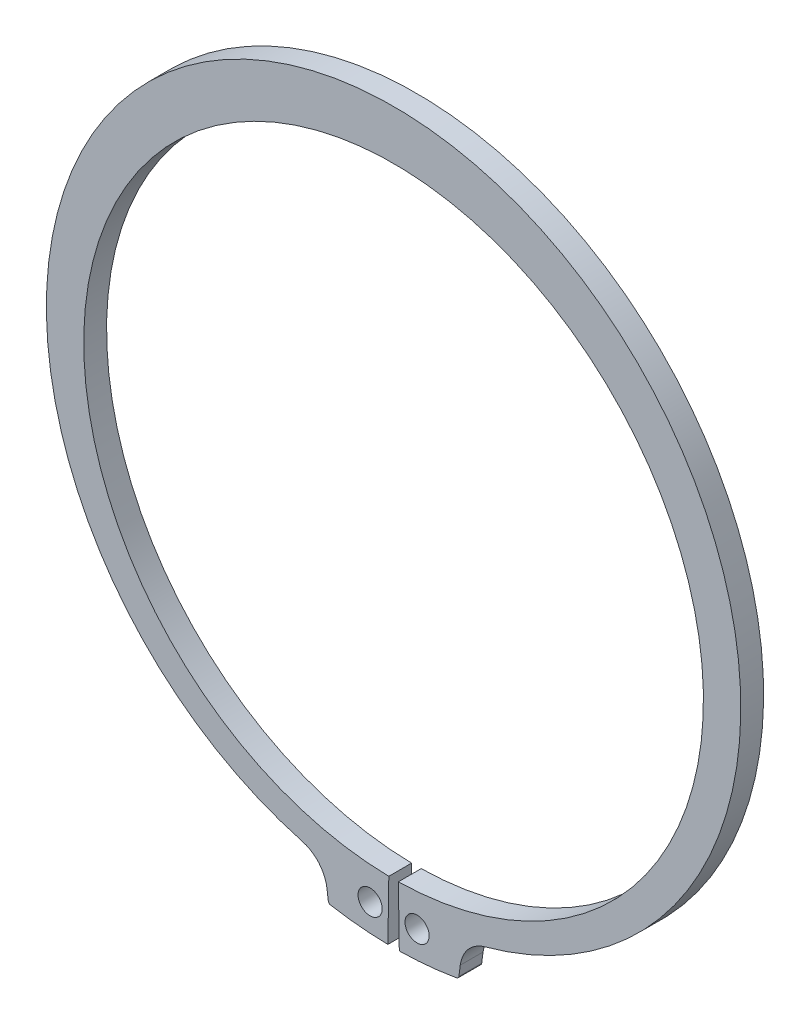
ISO-10303-21;
HEADER;
FILE_DESCRIPTION(('STEP AP214'),'2;1');
FILE_NAME('part.step','',(''),(''),'','','');
FILE_SCHEMA(('AUTOMOTIVE_DESIGN { 1 0 10303 214 1 1 1 1 }'));
ENDSEC;
DATA;
#1=APPLICATION_CONTEXT('core data for automotive mechanical design processes');
#2=APPLICATION_PROTOCOL_DEFINITION('international standard','automotive_design',2000,#1);
#3=PRODUCT_CONTEXT('',#1,'mechanical');
#4=PRODUCT('Part','Part','',(#3));
#5=PRODUCT_RELATED_PRODUCT_CATEGORY('part','',(#4));
#6=PRODUCT_DEFINITION_FORMATION('','',#4);
#7=PRODUCT_DEFINITION_CONTEXT('part definition',#1,'design');
#8=PRODUCT_DEFINITION('design','',#6,#7);
#9=PRODUCT_DEFINITION_SHAPE('','',#8);
#10=(LENGTH_UNIT() NAMED_UNIT(*) SI_UNIT(.MILLI.,.METRE.));
#11=(NAMED_UNIT(*) PLANE_ANGLE_UNIT() SI_UNIT($,.RADIAN.));
#12=(NAMED_UNIT(*) SI_UNIT($,.STERADIAN.) SOLID_ANGLE_UNIT());
#13=UNCERTAINTY_MEASURE_WITH_UNIT(LENGTH_MEASURE(1.E-05),#10,'distance_accuracy_value','');
#14=(GEOMETRIC_REPRESENTATION_CONTEXT(3) GLOBAL_UNCERTAINTY_ASSIGNED_CONTEXT((#13)) GLOBAL_UNIT_ASSIGNED_CONTEXT((#10,
#11,#12)) REPRESENTATION_CONTEXT('',''));
#15=CARTESIAN_POINT('',(0.,0.,0.));
#16=DIRECTION('',(0.,0.,1.));
#17=DIRECTION('',(1.,0.,0.));
#18=AXIS2_PLACEMENT_3D('',#15,#16,#17);
#19=CARTESIAN_POINT('',(0.,0.,-3.));
#20=DIRECTION('',(0.,0.,1.));
#21=DIRECTION('',(1.,0.,0.));
#22=AXIS2_PLACEMENT_3D('',#19,#20,#21);
#23=CYLINDRICAL_SURFACE('',#22,40.75);
#24=CARTESIAN_POINT('',(0.,0.,0.));
#25=DIRECTION('',(0.,0.,-1.));
#26=DIRECTION('',(1.,0.,0.));
#27=AXIS2_PLACEMENT_3D('',#24,#25,#26);
#28=CIRCLE('',#27,40.75);
#29=CARTESIAN_POINT('',(-0.62920499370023,-40.7451420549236,0.));
#30=VERTEX_POINT('',#29);
#31=CARTESIAN_POINT('',(0.62920499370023,-40.7451420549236,0.));
#32=VERTEX_POINT('',#31);
#33=EDGE_CURVE('E119',#30,#32,#28,.T.);
#34=ORIENTED_EDGE('',*,*,#33,.F.);
#35=DIRECTION('',(0.,0.,1.));
#36=VECTOR('',#35,1.);
#37=CARTESIAN_POINT('',(-0.62920499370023,-40.7451420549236,-3.));
#38=LINE('',#37,#36);
#39=CARTESIAN_POINT('',(-0.62920499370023,-40.7451420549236,-3.));
#40=VERTEX_POINT('',#39);
#41=EDGE_CURVE('E11',#40,#30,#38,.T.);
#42=ORIENTED_EDGE('',*,*,#41,.F.);
#43=CARTESIAN_POINT('',(0.,0.,-3.));
#44=DIRECTION('',(0.,0.,-1.));
#45=DIRECTION('',(1.,0.,0.));
#46=AXIS2_PLACEMENT_3D('',#43,#44,#45);
#47=CIRCLE('',#46,40.75);
#48=CARTESIAN_POINT('',(0.62920499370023,-40.7451420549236,-3.));
#49=VERTEX_POINT('',#48);
#50=EDGE_CURVE('E121',#40,#49,#47,.T.);
#51=ORIENTED_EDGE('',*,*,#50,.T.);
#52=DIRECTION('',(0.,0.,1.));
#53=VECTOR('',#52,1.);
#54=CARTESIAN_POINT('',(0.62920499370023,-40.7451420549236,-3.));
#55=LINE('',#54,#53);
#56=EDGE_CURVE('E34',#49,#32,#55,.T.);
#57=ORIENTED_EDGE('',*,*,#56,.T.);
#58=EDGE_LOOP('',(#34,#42,#51,#57));
#59=FACE_BOUND('',#58,.T.);
#60=ADVANCED_FACE('F31',(#59),#23,.F.);
#61=CARTESIAN_POINT('',(-0.62920499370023,-40.7451420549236,-3.));
#62=DIRECTION('',(0.999880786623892,-0.0154406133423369,0.));
#63=DIRECTION('',(0.0154406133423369,0.999880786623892,0.));
#64=AXIS2_PLACEMENT_3D('',#61,#62,#63);
#65=PLANE('',#64);
#66=DIRECTION('',(0.0154406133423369,0.999880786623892,0.));
#67=VECTOR('',#66,1.);
#68=CARTESIAN_POINT('',(-0.62920499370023,-40.7451420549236,0.));
#69=LINE('',#68,#67);
#70=CARTESIAN_POINT('',(-0.75,-48.5674094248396,0.));
#71=VERTEX_POINT('',#70);
#72=EDGE_CURVE('E137',#71,#30,#69,.T.);
#73=ORIENTED_EDGE('',*,*,#72,.F.);
#74=DIRECTION('',(0.,0.,1.));
#75=VECTOR('',#74,1.);
#76=CARTESIAN_POINT('',(-0.75,-48.5674094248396,-3.));
#77=LINE('',#76,#75);
#78=CARTESIAN_POINT('',(-0.75,-48.5674094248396,-3.));
#79=VERTEX_POINT('',#78);
#80=EDGE_CURVE('E39',#79,#71,#77,.T.);
#81=ORIENTED_EDGE('',*,*,#80,.F.);
#82=DIRECTION('',(0.0154406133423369,0.999880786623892,0.));
#83=VECTOR('',#82,1.);
#84=CARTESIAN_POINT('',(-0.62920499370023,-40.7451420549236,-3.));
#85=LINE('',#84,#83);
#86=EDGE_CURVE('E126',#79,#40,#85,.T.);
#87=ORIENTED_EDGE('',*,*,#86,.T.);
#88=ORIENTED_EDGE('',*,*,#41,.T.);
#89=EDGE_LOOP('',(#73,#81,#87,#88));
#90=FACE_BOUND('',#89,.T.);
#91=ADVANCED_FACE('F249',(#90),#65,.T.);
#92=CARTESIAN_POINT('',(0.,0.,-3.));
#93=DIRECTION('',(0.,0.,1.));
#94=DIRECTION('',(1.,0.,0.));
#95=AXIS2_PLACEMENT_3D('',#92,#93,#94);
#96=CYLINDRICAL_SURFACE('',#95,48.5732);
#97=CARTESIAN_POINT('',(0.,0.,0.));
#98=DIRECTION('',(0.,0.,1.));
#99=DIRECTION('',(1.,0.,0.));
#100=AXIS2_PLACEMENT_3D('',#97,#98,#99);
#101=CIRCLE('',#100,48.5732);
#102=CARTESIAN_POINT('',(-8.27466896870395,-47.8631968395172,0.));
#103=VERTEX_POINT('',#102);
#104=EDGE_CURVE('E167',#103,#71,#101,.T.);
#105=ORIENTED_EDGE('',*,*,#104,.F.);
#106=DIRECTION('',(0.,0.,1.));
#107=VECTOR('',#106,1.);
#108=CARTESIAN_POINT('',(-8.27466896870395,-47.8631968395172,-3.));
#109=LINE('',#108,#107);
#110=CARTESIAN_POINT('',(-8.27466896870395,-47.8631968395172,-3.));
#111=VERTEX_POINT('',#110);
#112=EDGE_CURVE('E201',#111,#103,#109,.T.);
#113=ORIENTED_EDGE('',*,*,#112,.F.);
#114=CARTESIAN_POINT('',(0.,0.,-3.));
#115=DIRECTION('',(0.,0.,1.));
#116=DIRECTION('',(1.,0.,0.));
#117=AXIS2_PLACEMENT_3D('',#114,#115,#116);
#118=CIRCLE('',#117,48.5732);
#119=EDGE_CURVE('E197',#111,#79,#118,.T.);
#120=ORIENTED_EDGE('',*,*,#119,.T.);
#121=ORIENTED_EDGE('',*,*,#80,.T.);
#122=EDGE_LOOP('',(#105,#113,#120,#121));
#123=FACE_BOUND('',#122,.T.);
#124=ADVANCED_FACE('F254',(#123),#96,.T.);
#125=CARTESIAN_POINT('',(-8.20976385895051,-47.4877659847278,-3.));
#126=DIRECTION('',(0.,0.,1.));
#127=DIRECTION('',(1.,0.,0.));
#128=AXIS2_PLACEMENT_3D('',#125,#126,#127);
#129=CYLINDRICAL_SURFACE('',#128,0.380999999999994);
#130=CARTESIAN_POINT('',(-8.20976385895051,-47.4877659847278,0.));
#131=DIRECTION('',(0.,0.,1.));
#132=DIRECTION('',(1.,0.,0.));
#133=AXIS2_PLACEMENT_3D('',#130,#131,#132);
#134=CIRCLE('',#133,0.380999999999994);
#135=CARTESIAN_POINT('',(-8.58750435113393,-47.5374964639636,0.));
#136=VERTEX_POINT('',#135);
#137=EDGE_CURVE('E164',#136,#103,#134,.T.);
#138=ORIENTED_EDGE('',*,*,#137,.F.);
#139=DIRECTION('',(0.,0.,1.));
#140=VECTOR('',#139,1.);
#141=CARTESIAN_POINT('',(-8.58750435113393,-47.5374964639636,-3.));
#142=LINE('',#141,#140);
#143=CARTESIAN_POINT('',(-8.58750435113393,-47.5374964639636,-3.));
#144=VERTEX_POINT('',#143);
#145=EDGE_CURVE('E203',#144,#136,#142,.T.);
#146=ORIENTED_EDGE('',*,*,#145,.F.);
#147=CARTESIAN_POINT('',(-8.20976385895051,-47.4877659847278,-3.));
#148=DIRECTION('',(0.,0.,1.));
#149=DIRECTION('',(1.,0.,0.));
#150=AXIS2_PLACEMENT_3D('',#147,#148,#149);
#151=CIRCLE('',#150,0.380999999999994);
#152=EDGE_CURVE('E194',#144,#111,#151,.T.);
#153=ORIENTED_EDGE('',*,*,#152,.T.);
#154=ORIENTED_EDGE('',*,*,#112,.T.);
#155=EDGE_LOOP('',(#138,#146,#153,#154));
#156=FACE_BOUND('',#155,.T.);
#157=ADVANCED_FACE('F246',(#156),#129,.T.);
#158=CARTESIAN_POINT('',(-8.76722460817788,-46.1723855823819,-3.));
#159=DIRECTION('',(-0.991444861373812,-0.130526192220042,0.));
#160=DIRECTION('',(0.130526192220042,-0.991444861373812,0.));
#161=AXIS2_PLACEMENT_3D('',#158,#159,#160);
#162=PLANE('',#161);
#163=DIRECTION('',(0.130526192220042,-0.991444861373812,0.));
#164=VECTOR('',#163,1.);
#165=CARTESIAN_POINT('',(-8.76722460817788,-46.1723855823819,0.));
#166=LINE('',#165,#164);
#167=CARTESIAN_POINT('',(-8.76722460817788,-46.1723855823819,0.));
#168=VERTEX_POINT('',#167);
#169=EDGE_CURVE('E161',#168,#136,#166,.T.);
#170=ORIENTED_EDGE('',*,*,#169,.F.);
#171=DIRECTION('',(0.,0.,1.));
#172=VECTOR('',#171,1.);
#173=CARTESIAN_POINT('',(-8.76722460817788,-46.1723855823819,-3.));
#174=LINE('',#173,#172);
#175=CARTESIAN_POINT('',(-8.76722460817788,-46.1723855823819,-3.));
#176=VERTEX_POINT('',#175);
#177=EDGE_CURVE('E205',#176,#168,#174,.T.);
#178=ORIENTED_EDGE('',*,*,#177,.F.);
#179=DIRECTION('',(0.130526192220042,-0.991444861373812,0.));
#180=VECTOR('',#179,1.);
#181=CARTESIAN_POINT('',(-8.76722460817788,-46.1723855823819,-3.));
#182=LINE('',#181,#180);
#183=EDGE_CURVE('E191',#176,#144,#182,.T.);
#184=ORIENTED_EDGE('',*,*,#183,.T.);
#185=ORIENTED_EDGE('',*,*,#145,.T.);
#186=EDGE_LOOP('',(#170,#178,#184,#185));
#187=FACE_BOUND('',#186,.T.);
#188=ADVANCED_FACE('F242',(#187),#162,.T.);
#189=CARTESIAN_POINT('',(-13.1740177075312,-46.7525509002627,-3.));
#190=DIRECTION('',(0.,0.,1.));
#191=DIRECTION('',(1.,0.,0.));
#192=AXIS2_PLACEMENT_3D('',#189,#190,#191);
#193=CYLINDRICAL_SURFACE('',#192,4.44481914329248);
#194=CARTESIAN_POINT('',(-13.1740177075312,-46.7525509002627,0.));
#195=DIRECTION('',(0.,0.,-1.));
#196=DIRECTION('',(1.,0.,0.));
#197=AXIS2_PLACEMENT_3D('',#194,#195,#196);
#198=CIRCLE('',#197,4.44481914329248);
#199=CARTESIAN_POINT('',(-12.0053802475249,-42.464112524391,0.));
#200=VERTEX_POINT('',#199);
#201=EDGE_CURVE('E158',#200,#168,#198,.T.);
#202=ORIENTED_EDGE('',*,*,#201,.F.);
#203=DIRECTION('',(0.,0.,1.));
#204=VECTOR('',#203,1.);
#205=CARTESIAN_POINT('',(-12.0053802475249,-42.464112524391,-3.));
#206=LINE('',#205,#204);
#207=CARTESIAN_POINT('',(-12.0053802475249,-42.464112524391,-3.));
#208=VERTEX_POINT('',#207);
#209=EDGE_CURVE('E207',#208,#200,#206,.T.);
#210=ORIENTED_EDGE('',*,*,#209,.F.);
#211=CARTESIAN_POINT('',(-13.1740177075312,-46.7525509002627,-3.));
#212=DIRECTION('',(0.,0.,-1.));
#213=DIRECTION('',(1.,0.,0.));
#214=AXIS2_PLACEMENT_3D('',#211,#212,#213);
#215=CIRCLE('',#214,4.44481914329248);
#216=EDGE_CURVE('E188',#208,#176,#215,.T.);
#217=ORIENTED_EDGE('',*,*,#216,.T.);
#218=ORIENTED_EDGE('',*,*,#177,.T.);
#219=EDGE_LOOP('',(#202,#210,#217,#218));
#220=FACE_BOUND('',#219,.T.);
#221=ADVANCED_FACE('F238',(#220),#193,.F.);
#222=CARTESIAN_POINT('',(0.,1.59089609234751,-3.));
#223=DIRECTION('',(0.,0.,1.));
#224=DIRECTION('',(1.,0.,0.));
#225=AXIS2_PLACEMENT_3D('',#222,#223,#224);
#226=CYLINDRICAL_SURFACE('',#225,45.6615039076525);
#227=CARTESIAN_POINT('',(0.,1.59089609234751,0.));
#228=DIRECTION('',(0.,0.,1.));
#229=DIRECTION('',(1.,0.,0.));
#230=AXIS2_PLACEMENT_3D('',#227,#228,#229);
#231=CIRCLE('',#230,45.6615039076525);
#232=CARTESIAN_POINT('',(12.0053802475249,-42.464112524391,0.));
#233=VERTEX_POINT('',#232);
#234=EDGE_CURVE('E155',#233,#200,#231,.T.);
#235=ORIENTED_EDGE('',*,*,#234,.F.);
#236=DIRECTION('',(0.,0.,1.));
#237=VECTOR('',#236,1.);
#238=CARTESIAN_POINT('',(12.0053802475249,-42.464112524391,-3.));
#239=LINE('',#238,#237);
#240=CARTESIAN_POINT('',(12.0053802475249,-42.464112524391,-3.));
#241=VERTEX_POINT('',#240);
#242=EDGE_CURVE('E209',#241,#233,#239,.T.);
#243=ORIENTED_EDGE('',*,*,#242,.F.);
#244=CARTESIAN_POINT('',(0.,1.59089609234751,-3.));
#245=DIRECTION('',(0.,0.,1.));
#246=DIRECTION('',(1.,0.,0.));
#247=AXIS2_PLACEMENT_3D('',#244,#245,#246);
#248=CIRCLE('',#247,45.6615039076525);
#249=EDGE_CURVE('E185',#241,#208,#248,.T.);
#250=ORIENTED_EDGE('',*,*,#249,.T.);
#251=ORIENTED_EDGE('',*,*,#209,.T.);
#252=EDGE_LOOP('',(#235,#243,#250,#251));
#253=FACE_BOUND('',#252,.T.);
#254=ADVANCED_FACE('F234',(#253),#226,.T.);
#255=CARTESIAN_POINT('',(13.1740177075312,-46.7525509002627,-3.));
#256=DIRECTION('',(0.,0.,1.));
#257=DIRECTION('',(1.,0.,0.));
#258=AXIS2_PLACEMENT_3D('',#255,#256,#257);
#259=CYLINDRICAL_SURFACE('',#258,4.44481914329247);
#260=CARTESIAN_POINT('',(13.1740177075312,-46.7525509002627,0.));
#261=DIRECTION('',(0.,0.,-1.));
#262=DIRECTION('',(1.,0.,0.));
#263=AXIS2_PLACEMENT_3D('',#260,#261,#262);
#264=CIRCLE('',#263,4.44481914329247);
#265=CARTESIAN_POINT('',(8.76722460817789,-46.1723855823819,0.));
#266=VERTEX_POINT('',#265);
#267=EDGE_CURVE('E152',#266,#233,#264,.T.);
#268=ORIENTED_EDGE('',*,*,#267,.F.);
#269=DIRECTION('',(0.,0.,1.));
#270=VECTOR('',#269,1.);
#271=CARTESIAN_POINT('',(8.76722460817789,-46.1723855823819,-3.));
#272=LINE('',#271,#270);
#273=CARTESIAN_POINT('',(8.76722460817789,-46.1723855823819,-3.));
#274=VERTEX_POINT('',#273);
#275=EDGE_CURVE('E211',#274,#266,#272,.T.);
#276=ORIENTED_EDGE('',*,*,#275,.F.);
#277=CARTESIAN_POINT('',(13.1740177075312,-46.7525509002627,-3.));
#278=DIRECTION('',(0.,0.,-1.));
#279=DIRECTION('',(1.,0.,0.));
#280=AXIS2_PLACEMENT_3D('',#277,#278,#279);
#281=CIRCLE('',#280,4.44481914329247);
#282=EDGE_CURVE('E182',#274,#241,#281,.T.);
#283=ORIENTED_EDGE('',*,*,#282,.T.);
#284=ORIENTED_EDGE('',*,*,#242,.T.);
#285=EDGE_LOOP('',(#268,#276,#283,#284));
#286=FACE_BOUND('',#285,.T.);
#287=ADVANCED_FACE('F230',(#286),#259,.F.);
#288=CARTESIAN_POINT('',(8.76722460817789,-46.1723855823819,-3.));
#289=DIRECTION('',(0.991444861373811,-0.130526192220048,0.));
#290=DIRECTION('',(0.130526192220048,0.991444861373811,0.));
#291=AXIS2_PLACEMENT_3D('',#288,#289,#290);
#292=PLANE('',#291);
#293=DIRECTION('',(0.130526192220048,0.991444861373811,0.));
#294=VECTOR('',#293,1.);
#295=CARTESIAN_POINT('',(8.76722460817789,-46.1723855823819,0.));
#296=LINE('',#295,#294);
#297=CARTESIAN_POINT('',(8.58750435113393,-47.5374964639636,0.));
#298=VERTEX_POINT('',#297);
#299=EDGE_CURVE('E149',#298,#266,#296,.T.);
#300=ORIENTED_EDGE('',*,*,#299,.F.);
#301=DIRECTION('',(0.,0.,1.));
#302=VECTOR('',#301,1.);
#303=CARTESIAN_POINT('',(8.58750435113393,-47.5374964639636,-3.));
#304=LINE('',#303,#302);
#305=CARTESIAN_POINT('',(8.58750435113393,-47.5374964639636,-3.));
#306=VERTEX_POINT('',#305);
#307=EDGE_CURVE('E213',#306,#298,#304,.T.);
#308=ORIENTED_EDGE('',*,*,#307,.F.);
#309=DIRECTION('',(0.130526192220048,0.991444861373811,0.));
#310=VECTOR('',#309,1.);
#311=CARTESIAN_POINT('',(8.76722460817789,-46.1723855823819,-3.));
#312=LINE('',#311,#310);
#313=EDGE_CURVE('E179',#306,#274,#312,.T.);
#314=ORIENTED_EDGE('',*,*,#313,.T.);
#315=ORIENTED_EDGE('',*,*,#275,.T.);
#316=EDGE_LOOP('',(#300,#308,#314,#315));
#317=FACE_BOUND('',#316,.T.);
#318=ADVANCED_FACE('F226',(#317),#292,.T.);
#319=CARTESIAN_POINT('',(8.20976385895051,-47.4877659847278,-3.));
#320=DIRECTION('',(0.,0.,1.));
#321=DIRECTION('',(1.,0.,0.));
#322=AXIS2_PLACEMENT_3D('',#319,#320,#321);
#323=CYLINDRICAL_SURFACE('',#322,0.380999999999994);
#324=CARTESIAN_POINT('',(8.20976385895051,-47.4877659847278,0.));
#325=DIRECTION('',(0.,0.,1.));
#326=DIRECTION('',(-1.,0.,0.));
#327=AXIS2_PLACEMENT_3D('',#324,#325,#326);
#328=CIRCLE('',#327,0.380999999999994);
#329=CARTESIAN_POINT('',(8.27466896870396,-47.8631968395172,0.));
#330=VERTEX_POINT('',#329);
#331=EDGE_CURVE('E146',#330,#298,#328,.T.);
#332=ORIENTED_EDGE('',*,*,#331,.F.);
#333=DIRECTION('',(0.,0.,1.));
#334=VECTOR('',#333,1.);
#335=CARTESIAN_POINT('',(8.27466896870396,-47.8631968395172,-3.));
#336=LINE('',#335,#334);
#337=CARTESIAN_POINT('',(8.27466896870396,-47.8631968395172,-3.));
#338=VERTEX_POINT('',#337);
#339=EDGE_CURVE('E215',#338,#330,#336,.T.);
#340=ORIENTED_EDGE('',*,*,#339,.F.);
#341=CARTESIAN_POINT('',(8.20976385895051,-47.4877659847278,-3.));
#342=DIRECTION('',(0.,0.,1.));
#343=DIRECTION('',(-1.,0.,0.));
#344=AXIS2_PLACEMENT_3D('',#341,#342,#343);
#345=CIRCLE('',#344,0.380999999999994);
#346=EDGE_CURVE('E176',#338,#306,#345,.T.);
#347=ORIENTED_EDGE('',*,*,#346,.T.);
#348=ORIENTED_EDGE('',*,*,#307,.T.);
#349=EDGE_LOOP('',(#332,#340,#347,#348));
#350=FACE_BOUND('',#349,.T.);
#351=ADVANCED_FACE('F222',(#350),#323,.T.);
#352=CARTESIAN_POINT('',(0.,0.,-3.));
#353=DIRECTION('',(0.,0.,1.));
#354=DIRECTION('',(1.,0.,0.));
#355=AXIS2_PLACEMENT_3D('',#352,#353,#354);
#356=CYLINDRICAL_SURFACE('',#355,48.5732);
#357=CARTESIAN_POINT('',(0.,0.,0.));
#358=DIRECTION('',(0.,0.,1.));
#359=DIRECTION('',(1.,0.,0.));
#360=AXIS2_PLACEMENT_3D('',#357,#358,#359);
#361=CIRCLE('',#360,48.5732);
#362=CARTESIAN_POINT('',(0.749999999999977,-48.5674094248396,0.));
#363=VERTEX_POINT('',#362);
#364=EDGE_CURVE('E133',#363,#330,#361,.T.);
#365=ORIENTED_EDGE('',*,*,#364,.F.);
#366=DIRECTION('',(0.,0.,1.));
#367=VECTOR('',#366,1.);
#368=CARTESIAN_POINT('',(0.749999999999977,-48.5674094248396,-3.));
#369=LINE('',#368,#367);
#370=CARTESIAN_POINT('',(0.749999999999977,-48.5674094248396,-3.));
#371=VERTEX_POINT('',#370);
#372=EDGE_CURVE('E125',#371,#363,#369,.T.);
#373=ORIENTED_EDGE('',*,*,#372,.F.);
#374=CARTESIAN_POINT('',(0.,0.,-3.));
#375=DIRECTION('',(0.,0.,1.));
#376=DIRECTION('',(1.,0.,0.));
#377=AXIS2_PLACEMENT_3D('',#374,#375,#376);
#378=CIRCLE('',#377,48.5732);
#379=EDGE_CURVE('E173',#371,#338,#378,.T.);
#380=ORIENTED_EDGE('',*,*,#379,.T.);
#381=ORIENTED_EDGE('',*,*,#339,.T.);
#382=EDGE_LOOP('',(#365,#373,#380,#381));
#383=FACE_BOUND('',#382,.T.);
#384=ADVANCED_FACE('F218',(#383),#356,.T.);
#385=CARTESIAN_POINT('',(0.62920499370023,-40.7451420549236,-3.));
#386=DIRECTION('',(-0.999880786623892,-0.0154406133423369,0.));
#387=DIRECTION('',(0.0154406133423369,-0.999880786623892,0.));
#388=AXIS2_PLACEMENT_3D('',#385,#386,#387);
#389=PLANE('',#388);
#390=DIRECTION('',(0.0154406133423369,-0.999880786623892,0.));
#391=VECTOR('',#390,1.);
#392=CARTESIAN_POINT('',(0.62920499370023,-40.7451420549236,0.));
#393=LINE('',#392,#391);
#394=EDGE_CURVE('E128',#32,#363,#393,.T.);
#395=ORIENTED_EDGE('',*,*,#394,.F.);
#396=ORIENTED_EDGE('',*,*,#56,.F.);
#397=DIRECTION('',(0.0154406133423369,-0.999880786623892,0.));
#398=VECTOR('',#397,1.);
#399=CARTESIAN_POINT('',(0.62920499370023,-40.7451420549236,-3.));
#400=LINE('',#399,#398);
#401=EDGE_CURVE('E171',#49,#371,#400,.T.);
#402=ORIENTED_EDGE('',*,*,#401,.T.);
#403=ORIENTED_EDGE('',*,*,#372,.T.);
#404=EDGE_LOOP('',(#395,#396,#402,#403));
#405=FACE_BOUND('',#404,.T.);
#406=ADVANCED_FACE('F129',(#405),#389,.T.);
#407=CARTESIAN_POINT('',(0.,0.,-3.));
#408=DIRECTION('',(0.,0.,1.));
#409=DIRECTION('',(1.,0.,0.));
#410=AXIS2_PLACEMENT_3D('',#407,#408,#409);
#411=PLANE('',#410);
#412=CARTESIAN_POINT('',(-3.0875,-44.8939566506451,-3.));
#413=DIRECTION('',(0.,0.,1.));
#414=DIRECTION('',(1.,0.,0.));
#415=AXIS2_PLACEMENT_3D('',#412,#413,#414);
#416=CIRCLE('',#415,1.5875);
#417=CARTESIAN_POINT('',(-1.5,-44.8939566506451,-3.));
#418=VERTEX_POINT('',#417);
#419=EDGE_CURVE('E388',#418,#418,#416,.T.);
#420=ORIENTED_EDGE('',*,*,#419,.T.);
#421=EDGE_LOOP('',(#420));
#422=FACE_BOUND('',#421,.T.);
#423=CARTESIAN_POINT('',(3.0875,-44.8939566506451,-3.));
#424=DIRECTION('',(0.,0.,1.));
#425=DIRECTION('',(1.,0.,0.));
#426=AXIS2_PLACEMENT_3D('',#423,#424,#425);
#427=CIRCLE('',#426,1.5875);
#428=CARTESIAN_POINT('',(4.675,-44.8939566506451,-3.));
#429=VERTEX_POINT('',#428);
#430=EDGE_CURVE('E138',#429,#429,#427,.T.);
#431=ORIENTED_EDGE('',*,*,#430,.T.);
#432=EDGE_LOOP('',(#431));
#433=FACE_BOUND('',#432,.T.);
#434=ORIENTED_EDGE('',*,*,#50,.F.);
#435=ORIENTED_EDGE('',*,*,#86,.F.);
#436=ORIENTED_EDGE('',*,*,#119,.F.);
#437=ORIENTED_EDGE('',*,*,#152,.F.);
#438=ORIENTED_EDGE('',*,*,#183,.F.);
#439=ORIENTED_EDGE('',*,*,#216,.F.);
#440=ORIENTED_EDGE('',*,*,#249,.F.);
#441=ORIENTED_EDGE('',*,*,#282,.F.);
#442=ORIENTED_EDGE('',*,*,#313,.F.);
#443=ORIENTED_EDGE('',*,*,#346,.F.);
#444=ORIENTED_EDGE('',*,*,#379,.F.);
#445=ORIENTED_EDGE('',*,*,#401,.F.);
#446=EDGE_LOOP('',(#434,#435,#436,#437,#438,#439,#440,#441,#442,#443,#444,#445));
#447=FACE_BOUND('',#446,.T.);
#448=ADVANCED_FACE('F253',(#422,#433,#447),#411,.F.);
#449=CARTESIAN_POINT('',(0.,0.,0.));
#450=DIRECTION('',(0.,0.,1.));
#451=DIRECTION('',(1.,0.,0.));
#452=AXIS2_PLACEMENT_3D('',#449,#450,#451);
#453=PLANE('',#452);
#454=CARTESIAN_POINT('',(-3.0875,-44.8939566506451,0.));
#455=DIRECTION('',(0.,0.,1.));
#456=DIRECTION('',(1.,0.,0.));
#457=AXIS2_PLACEMENT_3D('',#454,#455,#456);
#458=CIRCLE('',#457,1.5875);
#459=CARTESIAN_POINT('',(-1.5,-44.8939566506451,0.));
#460=VERTEX_POINT('',#459);
#461=EDGE_CURVE('E391',#460,#460,#458,.T.);
#462=ORIENTED_EDGE('',*,*,#461,.F.);
#463=EDGE_LOOP('',(#462));
#464=FACE_BOUND('',#463,.T.);
#465=CARTESIAN_POINT('',(3.0875,-44.8939566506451,0.));
#466=DIRECTION('',(0.,0.,1.));
#467=DIRECTION('',(1.,0.,0.));
#468=AXIS2_PLACEMENT_3D('',#465,#466,#467);
#469=CIRCLE('',#468,1.5875);
#470=CARTESIAN_POINT('',(4.675,-44.8939566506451,0.));
#471=VERTEX_POINT('',#470);
#472=EDGE_CURVE('E141',#471,#471,#469,.T.);
#473=ORIENTED_EDGE('',*,*,#472,.F.);
#474=EDGE_LOOP('',(#473));
#475=FACE_BOUND('',#474,.T.);
#476=ORIENTED_EDGE('',*,*,#33,.T.);
#477=ORIENTED_EDGE('',*,*,#394,.T.);
#478=ORIENTED_EDGE('',*,*,#364,.T.);
#479=ORIENTED_EDGE('',*,*,#331,.T.);
#480=ORIENTED_EDGE('',*,*,#299,.T.);
#481=ORIENTED_EDGE('',*,*,#267,.T.);
#482=ORIENTED_EDGE('',*,*,#234,.T.);
#483=ORIENTED_EDGE('',*,*,#201,.T.);
#484=ORIENTED_EDGE('',*,*,#169,.T.);
#485=ORIENTED_EDGE('',*,*,#137,.T.);
#486=ORIENTED_EDGE('',*,*,#104,.T.);
#487=ORIENTED_EDGE('',*,*,#72,.T.);
#488=EDGE_LOOP('',(#476,#477,#478,#479,#480,#481,#482,#483,#484,#485,#486,#487));
#489=FACE_BOUND('',#488,.T.);
#490=ADVANCED_FACE('F135',(#464,#475,#489),#453,.T.);
#491=CARTESIAN_POINT('',(3.0875,-44.8939566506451,-3.));
#492=DIRECTION('',(0.,0.,1.));
#493=DIRECTION('',(1.,0.,0.));
#494=AXIS2_PLACEMENT_3D('',#491,#492,#493);
#495=CYLINDRICAL_SURFACE('',#494,1.5875);
#496=ORIENTED_EDGE('',*,*,#430,.F.);
#497=EDGE_LOOP('',(#496));
#498=FACE_BOUND('',#497,.T.);
#499=ORIENTED_EDGE('',*,*,#472,.T.);
#500=EDGE_LOOP('',(#499));
#501=FACE_BOUND('',#500,.T.);
#502=ADVANCED_FACE('F361',(#498,#501),#495,.F.);
#503=CARTESIAN_POINT('',(-3.0875,-44.8939566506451,-3.));
#504=DIRECTION('',(0.,0.,1.));
#505=DIRECTION('',(1.,0.,0.));
#506=AXIS2_PLACEMENT_3D('',#503,#504,#505);
#507=CYLINDRICAL_SURFACE('',#506,1.5875);
#508=ORIENTED_EDGE('',*,*,#419,.F.);
#509=EDGE_LOOP('',(#508));
#510=FACE_BOUND('',#509,.T.);
#511=ORIENTED_EDGE('',*,*,#461,.T.);
#512=EDGE_LOOP('',(#511));
#513=FACE_BOUND('',#512,.T.);
#514=ADVANCED_FACE('F371',(#510,#513),#507,.F.);
#515=CLOSED_SHELL('',(#60,#91,#124,#157,#188,#221,#254,#287,#318,#351,#384,#406,#448,#490,#502,#514));
#516=MANIFOLD_SOLID_BREP('B2',#515);
#517=ADVANCED_BREP_SHAPE_REPRESENTATION('',(#18,#516),#14);
#518=SHAPE_DEFINITION_REPRESENTATION(#9,#517);
ENDSEC;
END-ISO-10303-21;
